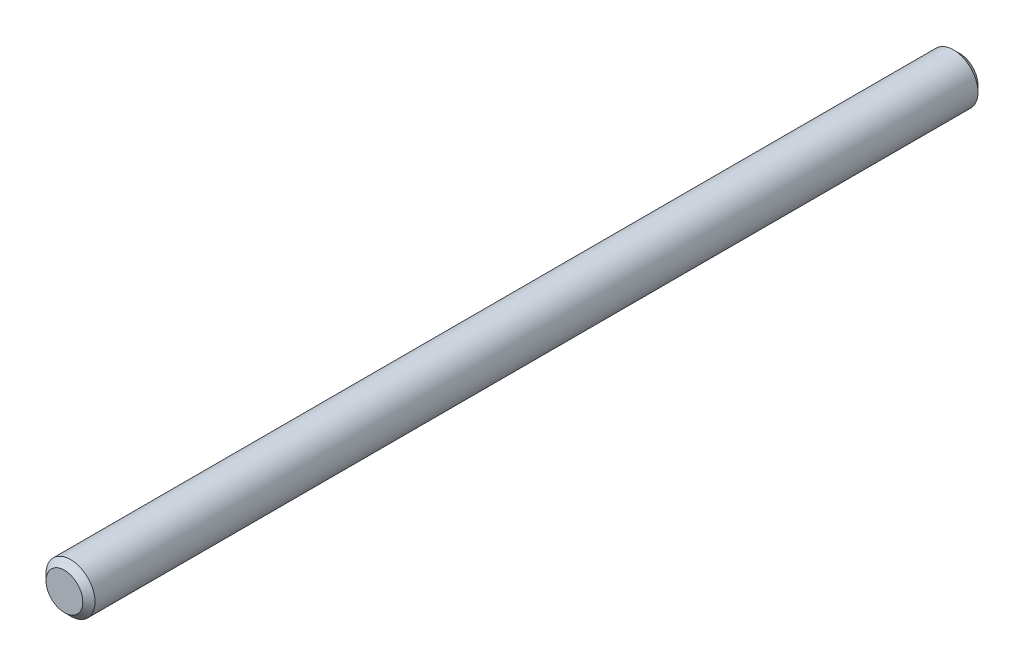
ISO-10303-21;
HEADER;
FILE_DESCRIPTION(('STEP AP214'),'2;1');
FILE_NAME('part.step','',(''),(''),'','','');
FILE_SCHEMA(('AUTOMOTIVE_DESIGN { 1 0 10303 214 1 1 1 1 }'));
ENDSEC;
DATA;
#1=APPLICATION_CONTEXT('core data for automotive mechanical design processes');
#2=APPLICATION_PROTOCOL_DEFINITION('international standard','automotive_design',2000,#1);
#3=PRODUCT_CONTEXT('',#1,'mechanical');
#4=PRODUCT('Part','Part','',(#3));
#5=PRODUCT_RELATED_PRODUCT_CATEGORY('part','',(#4));
#6=PRODUCT_DEFINITION_FORMATION('','',#4);
#7=PRODUCT_DEFINITION_CONTEXT('part definition',#1,'design');
#8=PRODUCT_DEFINITION('design','',#6,#7);
#9=PRODUCT_DEFINITION_SHAPE('','',#8);
#10=(LENGTH_UNIT() NAMED_UNIT(*) SI_UNIT(.MILLI.,.METRE.));
#11=(NAMED_UNIT(*) PLANE_ANGLE_UNIT() SI_UNIT($,.RADIAN.));
#12=(NAMED_UNIT(*) SI_UNIT($,.STERADIAN.) SOLID_ANGLE_UNIT());
#13=UNCERTAINTY_MEASURE_WITH_UNIT(LENGTH_MEASURE(1.E-05),#10,'distance_accuracy_value','');
#14=(GEOMETRIC_REPRESENTATION_CONTEXT(3) GLOBAL_UNCERTAINTY_ASSIGNED_CONTEXT((#13)) GLOBAL_UNIT_ASSIGNED_CONTEXT((#10,
#11,#12)) REPRESENTATION_CONTEXT('',''));
#15=CARTESIAN_POINT('',(0.,0.,0.));
#16=DIRECTION('',(0.,0.,1.));
#17=DIRECTION('',(1.,0.,0.));
#18=AXIS2_PLACEMENT_3D('',#15,#16,#17);
#19=CARTESIAN_POINT('',(12.,12.,-73.));
#20=DIRECTION('',(0.,0.,1.));
#21=DIRECTION('',(1.,0.,0.));
#22=AXIS2_PLACEMENT_3D('',#19,#20,#21);
#23=CYLINDRICAL_SURFACE('',#22,2.);
#24=CARTESIAN_POINT('',(12.,12.,-0.500000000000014));
#25=DIRECTION('',(0.,0.,1.));
#26=DIRECTION('',(1.,0.,0.));
#27=AXIS2_PLACEMENT_3D('',#24,#25,#26);
#28=CIRCLE('',#27,2.);
#29=CARTESIAN_POINT('',(14.,12.,-0.500000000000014));
#30=VERTEX_POINT('',#29);
#31=EDGE_CURVE('E30',#30,#30,#28,.F.);
#32=ORIENTED_EDGE('',*,*,#31,.T.);
#33=EDGE_LOOP('',(#32));
#34=FACE_BOUND('',#33,.T.);
#35=CARTESIAN_POINT('',(12.,12.,-72.5));
#36=DIRECTION('',(0.,0.,1.));
#37=DIRECTION('',(1.,0.,0.));
#38=AXIS2_PLACEMENT_3D('',#35,#36,#37);
#39=CIRCLE('',#38,2.);
#40=CARTESIAN_POINT('',(14.,12.,-72.5));
#41=VERTEX_POINT('',#40);
#42=EDGE_CURVE('E34',#41,#41,#39,.T.);
#43=ORIENTED_EDGE('',*,*,#42,.T.);
#44=EDGE_LOOP('',(#43));
#45=FACE_BOUND('',#44,.T.);
#46=ADVANCED_FACE('F24',(#34,#45),#23,.T.);
#47=CARTESIAN_POINT('',(12.,12.,-73.));
#48=DIRECTION('',(0.,0.,1.));
#49=DIRECTION('',(1.,0.,0.));
#50=AXIS2_PLACEMENT_3D('',#47,#48,#49);
#51=PLANE('',#50);
#52=CARTESIAN_POINT('',(12.,12.,-73.));
#53=DIRECTION('',(0.,0.,1.));
#54=DIRECTION('',(1.,0.,0.));
#55=AXIS2_PLACEMENT_3D('',#52,#53,#54);
#56=CIRCLE('',#55,1.5);
#57=CARTESIAN_POINT('',(13.5,12.,-73.));
#58=VERTEX_POINT('',#57);
#59=EDGE_CURVE('E10',#58,#58,#56,.F.);
#60=ORIENTED_EDGE('',*,*,#59,.T.);
#61=EDGE_LOOP('',(#60));
#62=FACE_BOUND('',#61,.T.);
#63=ADVANCED_FACE('F57',(#62),#51,.F.);
#64=CARTESIAN_POINT('',(12.,12.,0.));
#65=DIRECTION('',(0.,0.,1.));
#66=DIRECTION('',(1.,0.,0.));
#67=AXIS2_PLACEMENT_3D('',#64,#65,#66);
#68=PLANE('',#67);
#69=CARTESIAN_POINT('',(12.,12.,0.));
#70=DIRECTION('',(0.,0.,1.));
#71=DIRECTION('',(1.,0.,0.));
#72=AXIS2_PLACEMENT_3D('',#69,#70,#71);
#73=CIRCLE('',#72,1.5);
#74=CARTESIAN_POINT('',(13.5,12.,0.));
#75=VERTEX_POINT('',#74);
#76=EDGE_CURVE('E38',#75,#75,#73,.T.);
#77=ORIENTED_EDGE('',*,*,#76,.T.);
#78=EDGE_LOOP('',(#77));
#79=FACE_BOUND('',#78,.T.);
#80=ADVANCED_FACE('F44',(#79),#68,.T.);
#81=CARTESIAN_POINT('',(12.,12.,0.));
#82=DIRECTION('',(0.,0.,-1.));
#83=DIRECTION('',(-1.,0.,0.));
#84=AXIS2_PLACEMENT_3D('',#81,#82,#83);
#85=CONICAL_SURFACE('',#84,1.5,0.785398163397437);
#86=ORIENTED_EDGE('',*,*,#31,.F.);
#87=EDGE_LOOP('',(#86));
#88=FACE_BOUND('',#87,.T.);
#89=ORIENTED_EDGE('',*,*,#76,.F.);
#90=EDGE_LOOP('',(#89));
#91=FACE_BOUND('',#90,.T.);
#92=ADVANCED_FACE('F46',(#88,#91),#85,.T.);
#93=CARTESIAN_POINT('',(12.,12.,-72.5));
#94=DIRECTION('',(0.,0.,1.));
#95=DIRECTION('',(1.,0.,0.));
#96=AXIS2_PLACEMENT_3D('',#93,#94,#95);
#97=CONICAL_SURFACE('',#96,2.,0.785398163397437);
#98=ORIENTED_EDGE('',*,*,#59,.F.);
#99=EDGE_LOOP('',(#98));
#100=FACE_BOUND('',#99,.T.);
#101=ORIENTED_EDGE('',*,*,#42,.F.);
#102=EDGE_LOOP('',(#101));
#103=FACE_BOUND('',#102,.T.);
#104=ADVANCED_FACE('F48',(#100,#103),#97,.T.);
#105=CLOSED_SHELL('',(#46,#63,#80,#92,#104));
#106=MANIFOLD_SOLID_BREP('B2',#105);
#107=ADVANCED_BREP_SHAPE_REPRESENTATION('',(#18,#106),#14);
#108=SHAPE_DEFINITION_REPRESENTATION(#9,#107);
ENDSEC;
END-ISO-10303-21;
